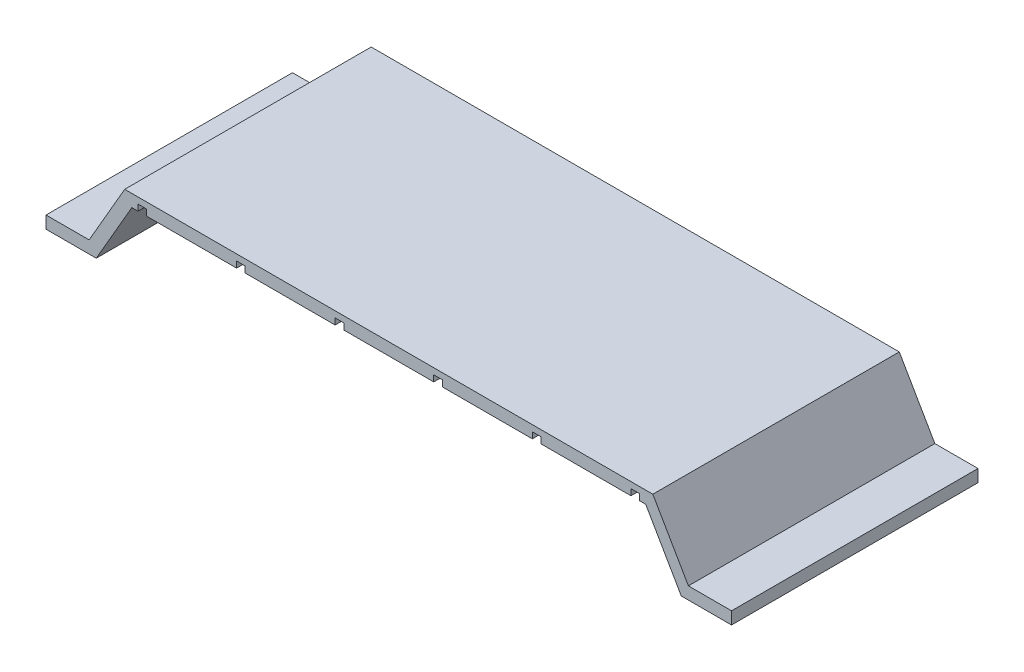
ISO-10303-21;
HEADER;
FILE_DESCRIPTION(('STEP AP214'),'2;1');
FILE_NAME('part.step','',(''),(''),'','','');
FILE_SCHEMA(('AUTOMOTIVE_DESIGN { 1 0 10303 214 1 1 1 1 }'));
ENDSEC;
DATA;
#1=APPLICATION_CONTEXT('core data for automotive mechanical design processes');
#2=APPLICATION_PROTOCOL_DEFINITION('international standard','automotive_design',2000,#1);
#3=PRODUCT_CONTEXT('',#1,'mechanical');
#4=PRODUCT('Part','Part','',(#3));
#5=PRODUCT_RELATED_PRODUCT_CATEGORY('part','',(#4));
#6=PRODUCT_DEFINITION_FORMATION('','',#4);
#7=PRODUCT_DEFINITION_CONTEXT('part definition',#1,'design');
#8=PRODUCT_DEFINITION('design','',#6,#7);
#9=PRODUCT_DEFINITION_SHAPE('','',#8);
#10=(LENGTH_UNIT() NAMED_UNIT(*) SI_UNIT(.MILLI.,.METRE.));
#11=(NAMED_UNIT(*) PLANE_ANGLE_UNIT() SI_UNIT($,.RADIAN.));
#12=(NAMED_UNIT(*) SI_UNIT($,.STERADIAN.) SOLID_ANGLE_UNIT());
#13=UNCERTAINTY_MEASURE_WITH_UNIT(LENGTH_MEASURE(1.E-05),#10,'distance_accuracy_value','');
#14=(GEOMETRIC_REPRESENTATION_CONTEXT(3) GLOBAL_UNCERTAINTY_ASSIGNED_CONTEXT((#13)) GLOBAL_UNIT_ASSIGNED_CONTEXT((#10,
#11,#12)) REPRESENTATION_CONTEXT('',''));
#15=CARTESIAN_POINT('',(0.,0.,0.));
#16=DIRECTION('',(0.,0.,1.));
#17=DIRECTION('',(1.,0.,0.));
#18=AXIS2_PLACEMENT_3D('',#15,#16,#17);
#19=CARTESIAN_POINT('',(-51.689,0.,25.4));
#20=DIRECTION('',(0.,1.,0.));
#21=DIRECTION('',(-1.,0.,0.));
#22=AXIS2_PLACEMENT_3D('',#19,#20,#21);
#23=PLANE('',#22);
#24=DIRECTION('',(1.,0.,0.));
#25=VECTOR('',#24,1.);
#26=CARTESIAN_POINT('',(-51.689,0.,-25.4));
#27=LINE('',#26,#25);
#28=CARTESIAN_POINT('',(-52.959,0.,-25.4));
#29=VERTEX_POINT('',#28);
#30=CARTESIAN_POINT('',(-51.689,0.,-25.4));
#31=VERTEX_POINT('',#30);
#32=EDGE_CURVE('E296',#29,#31,#27,.T.);
#33=ORIENTED_EDGE('',*,*,#32,.T.);
#34=DIRECTION('',(0.,0.,-1.));
#35=VECTOR('',#34,1.);
#36=CARTESIAN_POINT('',(-51.689,0.,25.4));
#37=LINE('',#36,#35);
#38=CARTESIAN_POINT('',(-51.689,0.,25.4));
#39=VERTEX_POINT('',#38);
#40=EDGE_CURVE('E11',#39,#31,#37,.T.);
#41=ORIENTED_EDGE('',*,*,#40,.F.);
#42=DIRECTION('',(1.,0.,0.));
#43=VECTOR('',#42,1.);
#44=CARTESIAN_POINT('',(-51.689,0.,25.4));
#45=LINE('',#44,#43);
#46=CARTESIAN_POINT('',(-52.959,0.,25.4));
#47=VERTEX_POINT('',#46);
#48=EDGE_CURVE('E366',#47,#39,#45,.T.);
#49=ORIENTED_EDGE('',*,*,#48,.F.);
#50=DIRECTION('',(0.,0.,-1.));
#51=VECTOR('',#50,1.);
#52=CARTESIAN_POINT('',(-52.959,0.,25.4));
#53=LINE('',#52,#51);
#54=EDGE_CURVE('E292',#47,#29,#53,.T.);
#55=ORIENTED_EDGE('',*,*,#54,.T.);
#56=EDGE_LOOP('',(#33,#41,#49,#55));
#57=FACE_BOUND('',#56,.T.);
#58=ADVANCED_FACE('F32',(#57),#23,.F.);
#59=CARTESIAN_POINT('',(-51.689,0.,25.4));
#60=DIRECTION('',(-1.,0.,0.));
#61=DIRECTION('',(0.,0.,1.));
#62=AXIS2_PLACEMENT_3D('',#59,#60,#61);
#63=PLANE('',#62);
#64=DIRECTION('',(0.,1.,0.));
#65=VECTOR('',#64,1.);
#66=CARTESIAN_POINT('',(-51.689,0.,-25.4));
#67=LINE('',#66,#65);
#68=CARTESIAN_POINT('',(-51.689,1.27,-25.4));
#69=VERTEX_POINT('',#68);
#70=EDGE_CURVE('E299',#31,#69,#67,.T.);
#71=ORIENTED_EDGE('',*,*,#70,.T.);
#72=DIRECTION('',(0.,0.,-1.));
#73=VECTOR('',#72,1.);
#74=CARTESIAN_POINT('',(-51.689,1.27,25.4));
#75=LINE('',#74,#73);
#76=CARTESIAN_POINT('',(-51.689,1.27,25.4));
#77=VERTEX_POINT('',#76);
#78=EDGE_CURVE('E40',#77,#69,#75,.T.);
#79=ORIENTED_EDGE('',*,*,#78,.F.);
#80=DIRECTION('',(0.,1.,0.));
#81=VECTOR('',#80,1.);
#82=CARTESIAN_POINT('',(-51.689,0.,25.4));
#83=LINE('',#82,#81);
#84=EDGE_CURVE('E175',#39,#77,#83,.T.);
#85=ORIENTED_EDGE('',*,*,#84,.F.);
#86=ORIENTED_EDGE('',*,*,#40,.T.);
#87=EDGE_LOOP('',(#71,#79,#85,#86));
#88=FACE_BOUND('',#87,.T.);
#89=ADVANCED_FACE('F564',(#88),#63,.F.);
#90=CARTESIAN_POINT('',(-51.689,1.27,25.4));
#91=DIRECTION('',(0.,1.,0.));
#92=DIRECTION('',(0.,0.,1.));
#93=AXIS2_PLACEMENT_3D('',#90,#91,#92);
#94=PLANE('',#93);
#95=DIRECTION('',(1.,0.,0.));
#96=VECTOR('',#95,1.);
#97=CARTESIAN_POINT('',(-51.689,1.27,-25.4));
#98=LINE('',#97,#96);
#99=CARTESIAN_POINT('',(-49.911,1.27,-25.4));
#100=VERTEX_POINT('',#99);
#101=EDGE_CURVE('E301',#69,#100,#98,.T.);
#102=ORIENTED_EDGE('',*,*,#101,.T.);
#103=DIRECTION('',(0.,0.,-1.));
#104=VECTOR('',#103,1.);
#105=CARTESIAN_POINT('',(-49.911,1.27,25.4));
#106=LINE('',#105,#104);
#107=CARTESIAN_POINT('',(-49.911,1.27,25.4));
#108=VERTEX_POINT('',#107);
#109=EDGE_CURVE('E457',#108,#100,#106,.T.);
#110=ORIENTED_EDGE('',*,*,#109,.F.);
#111=DIRECTION('',(1.,0.,0.));
#112=VECTOR('',#111,1.);
#113=CARTESIAN_POINT('',(-51.689,1.27,25.4));
#114=LINE('',#113,#112);
#115=EDGE_CURVE('E465',#77,#108,#114,.T.);
#116=ORIENTED_EDGE('',*,*,#115,.F.);
#117=ORIENTED_EDGE('',*,*,#78,.T.);
#118=EDGE_LOOP('',(#102,#110,#116,#117));
#119=FACE_BOUND('',#118,.T.);
#120=ADVANCED_FACE('F463',(#119),#94,.F.);
#121=CARTESIAN_POINT('',(-49.911,0.,25.4));
#122=DIRECTION('',(1.,0.,0.));
#123=DIRECTION('',(0.,0.,-1.));
#124=AXIS2_PLACEMENT_3D('',#121,#122,#123);
#125=PLANE('',#124);
#126=DIRECTION('',(0.,-1.,0.));
#127=VECTOR('',#126,1.);
#128=CARTESIAN_POINT('',(-49.911,0.,-25.4));
#129=LINE('',#128,#127);
#130=CARTESIAN_POINT('',(-49.911,0.,-25.4));
#131=VERTEX_POINT('',#130);
#132=EDGE_CURVE('E303',#100,#131,#129,.T.);
#133=ORIENTED_EDGE('',*,*,#132,.T.);
#134=DIRECTION('',(0.,0.,-1.));
#135=VECTOR('',#134,1.);
#136=CARTESIAN_POINT('',(-49.911,0.,25.4));
#137=LINE('',#136,#135);
#138=CARTESIAN_POINT('',(-49.911,0.,25.4));
#139=VERTEX_POINT('',#138);
#140=EDGE_CURVE('E454',#139,#131,#137,.T.);
#141=ORIENTED_EDGE('',*,*,#140,.F.);
#142=DIRECTION('',(0.,-1.,0.));
#143=VECTOR('',#142,1.);
#144=CARTESIAN_POINT('',(-49.911,0.,25.4));
#145=LINE('',#144,#143);
#146=EDGE_CURVE('E483',#108,#139,#145,.T.);
#147=ORIENTED_EDGE('',*,*,#146,.F.);
#148=ORIENTED_EDGE('',*,*,#109,.T.);
#149=EDGE_LOOP('',(#133,#141,#147,#148));
#150=FACE_BOUND('',#149,.T.);
#151=ADVANCED_FACE('F474',(#150),#125,.F.);
#152=CARTESIAN_POINT('',(-31.369,0.,25.4));
#153=DIRECTION('',(0.,1.,0.));
#154=DIRECTION('',(-1.,0.,0.));
#155=AXIS2_PLACEMENT_3D('',#152,#153,#154);
#156=PLANE('',#155);
#157=DIRECTION('',(1.,0.,0.));
#158=VECTOR('',#157,1.);
#159=CARTESIAN_POINT('',(-31.369,0.,-25.4));
#160=LINE('',#159,#158);
#161=CARTESIAN_POINT('',(-31.369,0.,-25.4));
#162=VERTEX_POINT('',#161);
#163=EDGE_CURVE('E305',#131,#162,#160,.T.);
#164=ORIENTED_EDGE('',*,*,#163,.T.);
#165=DIRECTION('',(0.,0.,-1.));
#166=VECTOR('',#165,1.);
#167=CARTESIAN_POINT('',(-31.369,0.,25.4));
#168=LINE('',#167,#166);
#169=CARTESIAN_POINT('',(-31.369,0.,25.4));
#170=VERTEX_POINT('',#169);
#171=EDGE_CURVE('E451',#170,#162,#168,.T.);
#172=ORIENTED_EDGE('',*,*,#171,.F.);
#173=DIRECTION('',(1.,0.,0.));
#174=VECTOR('',#173,1.);
#175=CARTESIAN_POINT('',(-31.369,0.,25.4));
#176=LINE('',#175,#174);
#177=EDGE_CURVE('E480',#139,#170,#176,.T.);
#178=ORIENTED_EDGE('',*,*,#177,.F.);
#179=ORIENTED_EDGE('',*,*,#140,.T.);
#180=EDGE_LOOP('',(#164,#172,#178,#179));
#181=FACE_BOUND('',#180,.T.);
#182=ADVANCED_FACE('F478',(#181),#156,.F.);
#183=CARTESIAN_POINT('',(-31.369,0.,25.4));
#184=DIRECTION('',(-1.,0.,0.));
#185=DIRECTION('',(0.,0.,1.));
#186=AXIS2_PLACEMENT_3D('',#183,#184,#185);
#187=PLANE('',#186);
#188=DIRECTION('',(0.,1.,0.));
#189=VECTOR('',#188,1.);
#190=CARTESIAN_POINT('',(-31.369,0.,-25.4));
#191=LINE('',#190,#189);
#192=CARTESIAN_POINT('',(-31.369,1.27,-25.4));
#193=VERTEX_POINT('',#192);
#194=EDGE_CURVE('E307',#162,#193,#191,.T.);
#195=ORIENTED_EDGE('',*,*,#194,.T.);
#196=DIRECTION('',(0.,0.,-1.));
#197=VECTOR('',#196,1.);
#198=CARTESIAN_POINT('',(-31.369,1.27,25.4));
#199=LINE('',#198,#197);
#200=CARTESIAN_POINT('',(-31.369,1.27,25.4));
#201=VERTEX_POINT('',#200);
#202=EDGE_CURVE('E448',#201,#193,#199,.T.);
#203=ORIENTED_EDGE('',*,*,#202,.F.);
#204=DIRECTION('',(0.,1.,0.));
#205=VECTOR('',#204,1.);
#206=CARTESIAN_POINT('',(-31.369,0.,25.4));
#207=LINE('',#206,#205);
#208=EDGE_CURVE('E482',#170,#201,#207,.T.);
#209=ORIENTED_EDGE('',*,*,#208,.F.);
#210=ORIENTED_EDGE('',*,*,#171,.T.);
#211=EDGE_LOOP('',(#195,#203,#209,#210));
#212=FACE_BOUND('',#211,.T.);
#213=ADVANCED_FACE('F577',(#212),#187,.F.);
#214=CARTESIAN_POINT('',(-31.369,1.27,25.4));
#215=DIRECTION('',(0.,1.,0.));
#216=DIRECTION('',(0.,0.,1.));
#217=AXIS2_PLACEMENT_3D('',#214,#215,#216);
#218=PLANE('',#217);
#219=DIRECTION('',(1.,0.,0.));
#220=VECTOR('',#219,1.);
#221=CARTESIAN_POINT('',(-31.369,1.27,-25.4));
#222=LINE('',#221,#220);
#223=CARTESIAN_POINT('',(-29.591,1.27,-25.4));
#224=VERTEX_POINT('',#223);
#225=EDGE_CURVE('E309',#193,#224,#222,.T.);
#226=ORIENTED_EDGE('',*,*,#225,.T.);
#227=DIRECTION('',(0.,0.,-1.));
#228=VECTOR('',#227,1.);
#229=CARTESIAN_POINT('',(-29.591,1.27,25.4));
#230=LINE('',#229,#228);
#231=CARTESIAN_POINT('',(-29.591,1.27,25.4));
#232=VERTEX_POINT('',#231);
#233=EDGE_CURVE('E445',#232,#224,#230,.T.);
#234=ORIENTED_EDGE('',*,*,#233,.F.);
#235=DIRECTION('',(1.,0.,0.));
#236=VECTOR('',#235,1.);
#237=CARTESIAN_POINT('',(-31.369,1.27,25.4));
#238=LINE('',#237,#236);
#239=EDGE_CURVE('E485',#201,#232,#238,.T.);
#240=ORIENTED_EDGE('',*,*,#239,.F.);
#241=ORIENTED_EDGE('',*,*,#202,.T.);
#242=EDGE_LOOP('',(#226,#234,#240,#241));
#243=FACE_BOUND('',#242,.T.);
#244=ADVANCED_FACE('F580',(#243),#218,.F.);
#245=CARTESIAN_POINT('',(-29.591,0.,25.4));
#246=DIRECTION('',(1.,0.,0.));
#247=DIRECTION('',(0.,0.,-1.));
#248=AXIS2_PLACEMENT_3D('',#245,#246,#247);
#249=PLANE('',#248);
#250=DIRECTION('',(0.,-1.,0.));
#251=VECTOR('',#250,1.);
#252=CARTESIAN_POINT('',(-29.591,0.,-25.4));
#253=LINE('',#252,#251);
#254=CARTESIAN_POINT('',(-29.591,0.,-25.4));
#255=VERTEX_POINT('',#254);
#256=EDGE_CURVE('E311',#224,#255,#253,.T.);
#257=ORIENTED_EDGE('',*,*,#256,.T.);
#258=DIRECTION('',(0.,0.,-1.));
#259=VECTOR('',#258,1.);
#260=CARTESIAN_POINT('',(-29.591,0.,25.4));
#261=LINE('',#260,#259);
#262=CARTESIAN_POINT('',(-29.591,0.,25.4));
#263=VERTEX_POINT('',#262);
#264=EDGE_CURVE('E442',#263,#255,#261,.T.);
#265=ORIENTED_EDGE('',*,*,#264,.F.);
#266=DIRECTION('',(0.,-1.,0.));
#267=VECTOR('',#266,1.);
#268=CARTESIAN_POINT('',(-29.591,0.,25.4));
#269=LINE('',#268,#267);
#270=EDGE_CURVE('E491',#232,#263,#269,.T.);
#271=ORIENTED_EDGE('',*,*,#270,.F.);
#272=ORIENTED_EDGE('',*,*,#233,.T.);
#273=EDGE_LOOP('',(#257,#265,#271,#272));
#274=FACE_BOUND('',#273,.T.);
#275=ADVANCED_FACE('F584',(#274),#249,.F.);
#276=CARTESIAN_POINT('',(-11.049,0.,25.4));
#277=DIRECTION('',(0.,1.,0.));
#278=DIRECTION('',(-1.,0.,0.));
#279=AXIS2_PLACEMENT_3D('',#276,#277,#278);
#280=PLANE('',#279);
#281=DIRECTION('',(1.,0.,0.));
#282=VECTOR('',#281,1.);
#283=CARTESIAN_POINT('',(-11.049,0.,-25.4));
#284=LINE('',#283,#282);
#285=CARTESIAN_POINT('',(-11.049,0.,-25.4));
#286=VERTEX_POINT('',#285);
#287=EDGE_CURVE('E313',#255,#286,#284,.T.);
#288=ORIENTED_EDGE('',*,*,#287,.T.);
#289=DIRECTION('',(0.,0.,-1.));
#290=VECTOR('',#289,1.);
#291=CARTESIAN_POINT('',(-11.049,0.,25.4));
#292=LINE('',#291,#290);
#293=CARTESIAN_POINT('',(-11.049,0.,25.4));
#294=VERTEX_POINT('',#293);
#295=EDGE_CURVE('E439',#294,#286,#292,.T.);
#296=ORIENTED_EDGE('',*,*,#295,.F.);
#297=DIRECTION('',(1.,0.,0.));
#298=VECTOR('',#297,1.);
#299=CARTESIAN_POINT('',(-11.049,0.,25.4));
#300=LINE('',#299,#298);
#301=EDGE_CURVE('E493',#263,#294,#300,.T.);
#302=ORIENTED_EDGE('',*,*,#301,.F.);
#303=ORIENTED_EDGE('',*,*,#264,.T.);
#304=EDGE_LOOP('',(#288,#296,#302,#303));
#305=FACE_BOUND('',#304,.T.);
#306=ADVANCED_FACE('F588',(#305),#280,.F.);
#307=CARTESIAN_POINT('',(-11.049,0.,25.4));
#308=DIRECTION('',(-1.,0.,0.));
#309=DIRECTION('',(0.,0.,1.));
#310=AXIS2_PLACEMENT_3D('',#307,#308,#309);
#311=PLANE('',#310);
#312=DIRECTION('',(0.,1.,0.));
#313=VECTOR('',#312,1.);
#314=CARTESIAN_POINT('',(-11.049,0.,-25.4));
#315=LINE('',#314,#313);
#316=CARTESIAN_POINT('',(-11.049,1.27,-25.4));
#317=VERTEX_POINT('',#316);
#318=EDGE_CURVE('E315',#286,#317,#315,.T.);
#319=ORIENTED_EDGE('',*,*,#318,.T.);
#320=DIRECTION('',(0.,0.,-1.));
#321=VECTOR('',#320,1.);
#322=CARTESIAN_POINT('',(-11.049,1.27,25.4));
#323=LINE('',#322,#321);
#324=CARTESIAN_POINT('',(-11.049,1.27,25.4));
#325=VERTEX_POINT('',#324);
#326=EDGE_CURVE('E436',#325,#317,#323,.T.);
#327=ORIENTED_EDGE('',*,*,#326,.F.);
#328=DIRECTION('',(0.,1.,0.));
#329=VECTOR('',#328,1.);
#330=CARTESIAN_POINT('',(-11.049,0.,25.4));
#331=LINE('',#330,#329);
#332=EDGE_CURVE('E495',#294,#325,#331,.T.);
#333=ORIENTED_EDGE('',*,*,#332,.F.);
#334=ORIENTED_EDGE('',*,*,#295,.T.);
#335=EDGE_LOOP('',(#319,#327,#333,#334));
#336=FACE_BOUND('',#335,.T.);
#337=ADVANCED_FACE('F592',(#336),#311,.F.);
#338=CARTESIAN_POINT('',(-11.049,1.27,25.4));
#339=DIRECTION('',(0.,1.,0.));
#340=DIRECTION('',(-1.,0.,0.));
#341=AXIS2_PLACEMENT_3D('',#338,#339,#340);
#342=PLANE('',#341);
#343=DIRECTION('',(1.,0.,0.));
#344=VECTOR('',#343,1.);
#345=CARTESIAN_POINT('',(-11.049,1.27,-25.4));
#346=LINE('',#345,#344);
#347=CARTESIAN_POINT('',(-9.271,1.27,-25.4));
#348=VERTEX_POINT('',#347);
#349=EDGE_CURVE('E317',#317,#348,#346,.T.);
#350=ORIENTED_EDGE('',*,*,#349,.T.);
#351=DIRECTION('',(0.,0.,-1.));
#352=VECTOR('',#351,1.);
#353=CARTESIAN_POINT('',(-9.271,1.27,25.4));
#354=LINE('',#353,#352);
#355=CARTESIAN_POINT('',(-9.271,1.27,25.4));
#356=VERTEX_POINT('',#355);
#357=EDGE_CURVE('E433',#356,#348,#354,.T.);
#358=ORIENTED_EDGE('',*,*,#357,.F.);
#359=DIRECTION('',(1.,0.,0.));
#360=VECTOR('',#359,1.);
#361=CARTESIAN_POINT('',(-11.049,1.27,25.4));
#362=LINE('',#361,#360);
#363=EDGE_CURVE('E497',#325,#356,#362,.T.);
#364=ORIENTED_EDGE('',*,*,#363,.F.);
#365=ORIENTED_EDGE('',*,*,#326,.T.);
#366=EDGE_LOOP('',(#350,#358,#364,#365));
#367=FACE_BOUND('',#366,.T.);
#368=ADVANCED_FACE('F596',(#367),#342,.F.);
#369=CARTESIAN_POINT('',(-9.271,0.,25.4));
#370=DIRECTION('',(1.,0.,0.));
#371=DIRECTION('',(0.,0.,-1.));
#372=AXIS2_PLACEMENT_3D('',#369,#370,#371);
#373=PLANE('',#372);
#374=DIRECTION('',(0.,-1.,0.));
#375=VECTOR('',#374,1.);
#376=CARTESIAN_POINT('',(-9.271,0.,-25.4));
#377=LINE('',#376,#375);
#378=CARTESIAN_POINT('',(-9.271,0.,-25.4));
#379=VERTEX_POINT('',#378);
#380=EDGE_CURVE('E319',#348,#379,#377,.T.);
#381=ORIENTED_EDGE('',*,*,#380,.T.);
#382=DIRECTION('',(0.,0.,-1.));
#383=VECTOR('',#382,1.);
#384=CARTESIAN_POINT('',(-9.271,0.,25.4));
#385=LINE('',#384,#383);
#386=CARTESIAN_POINT('',(-9.271,0.,25.4));
#387=VERTEX_POINT('',#386);
#388=EDGE_CURVE('E430',#387,#379,#385,.T.);
#389=ORIENTED_EDGE('',*,*,#388,.F.);
#390=DIRECTION('',(0.,-1.,0.));
#391=VECTOR('',#390,1.);
#392=CARTESIAN_POINT('',(-9.271,0.,25.4));
#393=LINE('',#392,#391);
#394=EDGE_CURVE('E499',#356,#387,#393,.T.);
#395=ORIENTED_EDGE('',*,*,#394,.F.);
#396=ORIENTED_EDGE('',*,*,#357,.T.);
#397=EDGE_LOOP('',(#381,#389,#395,#396));
#398=FACE_BOUND('',#397,.T.);
#399=ADVANCED_FACE('F600',(#398),#373,.F.);
#400=CARTESIAN_POINT('',(9.271,0.,25.4));
#401=DIRECTION('',(0.,1.,0.));
#402=DIRECTION('',(0.,0.,1.));
#403=AXIS2_PLACEMENT_3D('',#400,#401,#402);
#404=PLANE('',#403);
#405=DIRECTION('',(1.,0.,0.));
#406=VECTOR('',#405,1.);
#407=CARTESIAN_POINT('',(9.271,0.,-25.4));
#408=LINE('',#407,#406);
#409=CARTESIAN_POINT('',(9.271,0.,-25.4));
#410=VERTEX_POINT('',#409);
#411=EDGE_CURVE('E321',#379,#410,#408,.T.);
#412=ORIENTED_EDGE('',*,*,#411,.T.);
#413=DIRECTION('',(0.,0.,-1.));
#414=VECTOR('',#413,1.);
#415=CARTESIAN_POINT('',(9.271,0.,25.4));
#416=LINE('',#415,#414);
#417=CARTESIAN_POINT('',(9.271,0.,25.4));
#418=VERTEX_POINT('',#417);
#419=EDGE_CURVE('E427',#418,#410,#416,.T.);
#420=ORIENTED_EDGE('',*,*,#419,.F.);
#421=DIRECTION('',(1.,0.,0.));
#422=VECTOR('',#421,1.);
#423=CARTESIAN_POINT('',(9.271,0.,25.4));
#424=LINE('',#423,#422);
#425=EDGE_CURVE('E501',#387,#418,#424,.T.);
#426=ORIENTED_EDGE('',*,*,#425,.F.);
#427=ORIENTED_EDGE('',*,*,#388,.T.);
#428=EDGE_LOOP('',(#412,#420,#426,#427));
#429=FACE_BOUND('',#428,.T.);
#430=ADVANCED_FACE('F604',(#429),#404,.F.);
#431=CARTESIAN_POINT('',(9.271,0.,25.4));
#432=DIRECTION('',(-1.,0.,0.));
#433=DIRECTION('',(0.,0.,1.));
#434=AXIS2_PLACEMENT_3D('',#431,#432,#433);
#435=PLANE('',#434);
#436=DIRECTION('',(0.,1.,0.));
#437=VECTOR('',#436,1.);
#438=CARTESIAN_POINT('',(9.271,0.,-25.4));
#439=LINE('',#438,#437);
#440=CARTESIAN_POINT('',(9.271,1.27,-25.4));
#441=VERTEX_POINT('',#440);
#442=EDGE_CURVE('E323',#410,#441,#439,.T.);
#443=ORIENTED_EDGE('',*,*,#442,.T.);
#444=DIRECTION('',(0.,0.,-1.));
#445=VECTOR('',#444,1.);
#446=CARTESIAN_POINT('',(9.271,1.27,25.4));
#447=LINE('',#446,#445);
#448=CARTESIAN_POINT('',(9.271,1.27,25.4));
#449=VERTEX_POINT('',#448);
#450=EDGE_CURVE('E424',#449,#441,#447,.T.);
#451=ORIENTED_EDGE('',*,*,#450,.F.);
#452=DIRECTION('',(0.,1.,0.));
#453=VECTOR('',#452,1.);
#454=CARTESIAN_POINT('',(9.271,0.,25.4));
#455=LINE('',#454,#453);
#456=EDGE_CURVE('E503',#418,#449,#455,.T.);
#457=ORIENTED_EDGE('',*,*,#456,.F.);
#458=ORIENTED_EDGE('',*,*,#419,.T.);
#459=EDGE_LOOP('',(#443,#451,#457,#458));
#460=FACE_BOUND('',#459,.T.);
#461=ADVANCED_FACE('F608',(#460),#435,.F.);
#462=CARTESIAN_POINT('',(11.049,1.27,25.4));
#463=DIRECTION('',(0.,1.,0.));
#464=DIRECTION('',(-1.,0.,0.));
#465=AXIS2_PLACEMENT_3D('',#462,#463,#464);
#466=PLANE('',#465);
#467=DIRECTION('',(1.,0.,0.));
#468=VECTOR('',#467,1.);
#469=CARTESIAN_POINT('',(11.049,1.27,-25.4));
#470=LINE('',#469,#468);
#471=CARTESIAN_POINT('',(11.049,1.27,-25.4));
#472=VERTEX_POINT('',#471);
#473=EDGE_CURVE('E325',#441,#472,#470,.T.);
#474=ORIENTED_EDGE('',*,*,#473,.T.);
#475=DIRECTION('',(0.,0.,-1.));
#476=VECTOR('',#475,1.);
#477=CARTESIAN_POINT('',(11.049,1.27,25.4));
#478=LINE('',#477,#476);
#479=CARTESIAN_POINT('',(11.049,1.27,25.4));
#480=VERTEX_POINT('',#479);
#481=EDGE_CURVE('E421',#480,#472,#478,.T.);
#482=ORIENTED_EDGE('',*,*,#481,.F.);
#483=DIRECTION('',(1.,0.,0.));
#484=VECTOR('',#483,1.);
#485=CARTESIAN_POINT('',(11.049,1.27,25.4));
#486=LINE('',#485,#484);
#487=EDGE_CURVE('E505',#449,#480,#486,.T.);
#488=ORIENTED_EDGE('',*,*,#487,.F.);
#489=ORIENTED_EDGE('',*,*,#450,.T.);
#490=EDGE_LOOP('',(#474,#482,#488,#489));
#491=FACE_BOUND('',#490,.T.);
#492=ADVANCED_FACE('F612',(#491),#466,.F.);
#493=CARTESIAN_POINT('',(11.049,0.,25.4));
#494=DIRECTION('',(1.,0.,0.));
#495=DIRECTION('',(0.,0.,-1.));
#496=AXIS2_PLACEMENT_3D('',#493,#494,#495);
#497=PLANE('',#496);
#498=DIRECTION('',(0.,-1.,0.));
#499=VECTOR('',#498,1.);
#500=CARTESIAN_POINT('',(11.049,0.,-25.4));
#501=LINE('',#500,#499);
#502=CARTESIAN_POINT('',(11.049,0.,-25.4));
#503=VERTEX_POINT('',#502);
#504=EDGE_CURVE('E327',#472,#503,#501,.T.);
#505=ORIENTED_EDGE('',*,*,#504,.T.);
#506=DIRECTION('',(0.,0.,-1.));
#507=VECTOR('',#506,1.);
#508=CARTESIAN_POINT('',(11.049,0.,25.4));
#509=LINE('',#508,#507);
#510=CARTESIAN_POINT('',(11.049,0.,25.4));
#511=VERTEX_POINT('',#510);
#512=EDGE_CURVE('E418',#511,#503,#509,.T.);
#513=ORIENTED_EDGE('',*,*,#512,.F.);
#514=DIRECTION('',(0.,-1.,0.));
#515=VECTOR('',#514,1.);
#516=CARTESIAN_POINT('',(11.049,0.,25.4));
#517=LINE('',#516,#515);
#518=EDGE_CURVE('E507',#480,#511,#517,.T.);
#519=ORIENTED_EDGE('',*,*,#518,.F.);
#520=ORIENTED_EDGE('',*,*,#481,.T.);
#521=EDGE_LOOP('',(#505,#513,#519,#520));
#522=FACE_BOUND('',#521,.T.);
#523=ADVANCED_FACE('F616',(#522),#497,.F.);
#524=CARTESIAN_POINT('',(11.049,0.,25.4));
#525=DIRECTION('',(0.,1.,0.));
#526=DIRECTION('',(-1.,0.,0.));
#527=AXIS2_PLACEMENT_3D('',#524,#525,#526);
#528=PLANE('',#527);
#529=DIRECTION('',(1.,0.,0.));
#530=VECTOR('',#529,1.);
#531=CARTESIAN_POINT('',(11.049,0.,-25.4));
#532=LINE('',#531,#530);
#533=CARTESIAN_POINT('',(29.591,0.,-25.4));
#534=VERTEX_POINT('',#533);
#535=EDGE_CURVE('E329',#503,#534,#532,.T.);
#536=ORIENTED_EDGE('',*,*,#535,.T.);
#537=DIRECTION('',(0.,0.,-1.));
#538=VECTOR('',#537,1.);
#539=CARTESIAN_POINT('',(29.591,0.,25.4));
#540=LINE('',#539,#538);
#541=CARTESIAN_POINT('',(29.591,0.,25.4));
#542=VERTEX_POINT('',#541);
#543=EDGE_CURVE('E415',#542,#534,#540,.T.);
#544=ORIENTED_EDGE('',*,*,#543,.F.);
#545=DIRECTION('',(1.,0.,0.));
#546=VECTOR('',#545,1.);
#547=CARTESIAN_POINT('',(11.049,0.,25.4));
#548=LINE('',#547,#546);
#549=EDGE_CURVE('E509',#511,#542,#548,.T.);
#550=ORIENTED_EDGE('',*,*,#549,.F.);
#551=ORIENTED_EDGE('',*,*,#512,.T.);
#552=EDGE_LOOP('',(#536,#544,#550,#551));
#553=FACE_BOUND('',#552,.T.);
#554=ADVANCED_FACE('F620',(#553),#528,.F.);
#555=CARTESIAN_POINT('',(29.591,0.,25.4));
#556=DIRECTION('',(-1.,0.,0.));
#557=DIRECTION('',(0.,0.,1.));
#558=AXIS2_PLACEMENT_3D('',#555,#556,#557);
#559=PLANE('',#558);
#560=DIRECTION('',(0.,1.,0.));
#561=VECTOR('',#560,1.);
#562=CARTESIAN_POINT('',(29.591,0.,-25.4));
#563=LINE('',#562,#561);
#564=CARTESIAN_POINT('',(29.591,1.27,-25.4));
#565=VERTEX_POINT('',#564);
#566=EDGE_CURVE('E331',#534,#565,#563,.T.);
#567=ORIENTED_EDGE('',*,*,#566,.T.);
#568=DIRECTION('',(0.,0.,-1.));
#569=VECTOR('',#568,1.);
#570=CARTESIAN_POINT('',(29.591,1.27,25.4));
#571=LINE('',#570,#569);
#572=CARTESIAN_POINT('',(29.591,1.27,25.4));
#573=VERTEX_POINT('',#572);
#574=EDGE_CURVE('E412',#573,#565,#571,.T.);
#575=ORIENTED_EDGE('',*,*,#574,.F.);
#576=DIRECTION('',(0.,1.,0.));
#577=VECTOR('',#576,1.);
#578=CARTESIAN_POINT('',(29.591,0.,25.4));
#579=LINE('',#578,#577);
#580=EDGE_CURVE('E511',#542,#573,#579,.T.);
#581=ORIENTED_EDGE('',*,*,#580,.F.);
#582=ORIENTED_EDGE('',*,*,#543,.T.);
#583=EDGE_LOOP('',(#567,#575,#581,#582));
#584=FACE_BOUND('',#583,.T.);
#585=ADVANCED_FACE('F624',(#584),#559,.F.);
#586=CARTESIAN_POINT('',(31.369,1.27,25.4));
#587=DIRECTION('',(0.,1.,0.));
#588=DIRECTION('',(0.,0.,1.));
#589=AXIS2_PLACEMENT_3D('',#586,#587,#588);
#590=PLANE('',#589);
#591=DIRECTION('',(1.,0.,0.));
#592=VECTOR('',#591,1.);
#593=CARTESIAN_POINT('',(31.369,1.27,-25.4));
#594=LINE('',#593,#592);
#595=CARTESIAN_POINT('',(31.369,1.27,-25.4));
#596=VERTEX_POINT('',#595);
#597=EDGE_CURVE('E333',#565,#596,#594,.T.);
#598=ORIENTED_EDGE('',*,*,#597,.T.);
#599=DIRECTION('',(0.,0.,-1.));
#600=VECTOR('',#599,1.);
#601=CARTESIAN_POINT('',(31.369,1.27,25.4));
#602=LINE('',#601,#600);
#603=CARTESIAN_POINT('',(31.369,1.27,25.4));
#604=VERTEX_POINT('',#603);
#605=EDGE_CURVE('E409',#604,#596,#602,.T.);
#606=ORIENTED_EDGE('',*,*,#605,.F.);
#607=DIRECTION('',(1.,0.,0.));
#608=VECTOR('',#607,1.);
#609=CARTESIAN_POINT('',(31.369,1.27,25.4));
#610=LINE('',#609,#608);
#611=EDGE_CURVE('E513',#573,#604,#610,.T.);
#612=ORIENTED_EDGE('',*,*,#611,.F.);
#613=ORIENTED_EDGE('',*,*,#574,.T.);
#614=EDGE_LOOP('',(#598,#606,#612,#613));
#615=FACE_BOUND('',#614,.T.);
#616=ADVANCED_FACE('F628',(#615),#590,.F.);
#617=CARTESIAN_POINT('',(31.369,0.,25.4));
#618=DIRECTION('',(1.,0.,0.));
#619=DIRECTION('',(0.,0.,-1.));
#620=AXIS2_PLACEMENT_3D('',#617,#618,#619);
#621=PLANE('',#620);
#622=DIRECTION('',(0.,-1.,0.));
#623=VECTOR('',#622,1.);
#624=CARTESIAN_POINT('',(31.369,0.,-25.4));
#625=LINE('',#624,#623);
#626=CARTESIAN_POINT('',(31.369,0.,-25.4));
#627=VERTEX_POINT('',#626);
#628=EDGE_CURVE('E335',#596,#627,#625,.T.);
#629=ORIENTED_EDGE('',*,*,#628,.T.);
#630=DIRECTION('',(0.,0.,-1.));
#631=VECTOR('',#630,1.);
#632=CARTESIAN_POINT('',(31.369,0.,25.4));
#633=LINE('',#632,#631);
#634=CARTESIAN_POINT('',(31.369,0.,25.4));
#635=VERTEX_POINT('',#634);
#636=EDGE_CURVE('E406',#635,#627,#633,.T.);
#637=ORIENTED_EDGE('',*,*,#636,.F.);
#638=DIRECTION('',(0.,-1.,0.));
#639=VECTOR('',#638,1.);
#640=CARTESIAN_POINT('',(31.369,0.,25.4));
#641=LINE('',#640,#639);
#642=EDGE_CURVE('E515',#604,#635,#641,.T.);
#643=ORIENTED_EDGE('',*,*,#642,.F.);
#644=ORIENTED_EDGE('',*,*,#605,.T.);
#645=EDGE_LOOP('',(#629,#637,#643,#644));
#646=FACE_BOUND('',#645,.T.);
#647=ADVANCED_FACE('F632',(#646),#621,.F.);
#648=CARTESIAN_POINT('',(31.369,0.,25.4));
#649=DIRECTION('',(0.,1.,0.));
#650=DIRECTION('',(-1.,0.,0.));
#651=AXIS2_PLACEMENT_3D('',#648,#649,#650);
#652=PLANE('',#651);
#653=DIRECTION('',(1.,0.,0.));
#654=VECTOR('',#653,1.);
#655=CARTESIAN_POINT('',(31.369,0.,-25.4));
#656=LINE('',#655,#654);
#657=CARTESIAN_POINT('',(49.911,0.,-25.4));
#658=VERTEX_POINT('',#657);
#659=EDGE_CURVE('E337',#627,#658,#656,.T.);
#660=ORIENTED_EDGE('',*,*,#659,.T.);
#661=DIRECTION('',(0.,0.,-1.));
#662=VECTOR('',#661,1.);
#663=CARTESIAN_POINT('',(49.911,0.,25.4));
#664=LINE('',#663,#662);
#665=CARTESIAN_POINT('',(49.911,0.,25.4));
#666=VERTEX_POINT('',#665);
#667=EDGE_CURVE('E403',#666,#658,#664,.T.);
#668=ORIENTED_EDGE('',*,*,#667,.F.);
#669=DIRECTION('',(1.,0.,0.));
#670=VECTOR('',#669,1.);
#671=CARTESIAN_POINT('',(31.369,0.,25.4));
#672=LINE('',#671,#670);
#673=EDGE_CURVE('E517',#635,#666,#672,.T.);
#674=ORIENTED_EDGE('',*,*,#673,.F.);
#675=ORIENTED_EDGE('',*,*,#636,.T.);
#676=EDGE_LOOP('',(#660,#668,#674,#675));
#677=FACE_BOUND('',#676,.T.);
#678=ADVANCED_FACE('F636',(#677),#652,.F.);
#679=CARTESIAN_POINT('',(49.911,0.,25.4));
#680=DIRECTION('',(-1.,0.,0.));
#681=DIRECTION('',(0.,0.,1.));
#682=AXIS2_PLACEMENT_3D('',#679,#680,#681);
#683=PLANE('',#682);
#684=DIRECTION('',(0.,1.,0.));
#685=VECTOR('',#684,1.);
#686=CARTESIAN_POINT('',(49.911,0.,-25.4));
#687=LINE('',#686,#685);
#688=CARTESIAN_POINT('',(49.911,1.27,-25.4));
#689=VERTEX_POINT('',#688);
#690=EDGE_CURVE('E339',#658,#689,#687,.T.);
#691=ORIENTED_EDGE('',*,*,#690,.T.);
#692=DIRECTION('',(0.,0.,-1.));
#693=VECTOR('',#692,1.);
#694=CARTESIAN_POINT('',(49.911,1.27,25.4));
#695=LINE('',#694,#693);
#696=CARTESIAN_POINT('',(49.911,1.27,25.4));
#697=VERTEX_POINT('',#696);
#698=EDGE_CURVE('E400',#697,#689,#695,.T.);
#699=ORIENTED_EDGE('',*,*,#698,.F.);
#700=DIRECTION('',(0.,1.,0.));
#701=VECTOR('',#700,1.);
#702=CARTESIAN_POINT('',(49.911,0.,25.4));
#703=LINE('',#702,#701);
#704=EDGE_CURVE('E519',#666,#697,#703,.T.);
#705=ORIENTED_EDGE('',*,*,#704,.F.);
#706=ORIENTED_EDGE('',*,*,#667,.T.);
#707=EDGE_LOOP('',(#691,#699,#705,#706));
#708=FACE_BOUND('',#707,.T.);
#709=ADVANCED_FACE('F640',(#708),#683,.F.);
#710=CARTESIAN_POINT('',(51.689,1.27,25.4));
#711=DIRECTION('',(0.,1.,0.));
#712=DIRECTION('',(0.,0.,1.));
#713=AXIS2_PLACEMENT_3D('',#710,#711,#712);
#714=PLANE('',#713);
#715=DIRECTION('',(1.,0.,0.));
#716=VECTOR('',#715,1.);
#717=CARTESIAN_POINT('',(51.689,1.27,-25.4));
#718=LINE('',#717,#716);
#719=CARTESIAN_POINT('',(51.689,1.27,-25.4));
#720=VERTEX_POINT('',#719);
#721=EDGE_CURVE('E341',#689,#720,#718,.T.);
#722=ORIENTED_EDGE('',*,*,#721,.T.);
#723=DIRECTION('',(0.,0.,-1.));
#724=VECTOR('',#723,1.);
#725=CARTESIAN_POINT('',(51.689,1.27,25.4));
#726=LINE('',#725,#724);
#727=CARTESIAN_POINT('',(51.689,1.27,25.4));
#728=VERTEX_POINT('',#727);
#729=EDGE_CURVE('E397',#728,#720,#726,.T.);
#730=ORIENTED_EDGE('',*,*,#729,.F.);
#731=DIRECTION('',(1.,0.,0.));
#732=VECTOR('',#731,1.);
#733=CARTESIAN_POINT('',(51.689,1.27,25.4));
#734=LINE('',#733,#732);
#735=EDGE_CURVE('E521',#697,#728,#734,.T.);
#736=ORIENTED_EDGE('',*,*,#735,.F.);
#737=ORIENTED_EDGE('',*,*,#698,.T.);
#738=EDGE_LOOP('',(#722,#730,#736,#737));
#739=FACE_BOUND('',#738,.T.);
#740=ADVANCED_FACE('F644',(#739),#714,.F.);
#741=CARTESIAN_POINT('',(51.689,0.,25.4));
#742=DIRECTION('',(1.,0.,0.));
#743=DIRECTION('',(0.,0.,-1.));
#744=AXIS2_PLACEMENT_3D('',#741,#742,#743);
#745=PLANE('',#744);
#746=DIRECTION('',(0.,-1.,0.));
#747=VECTOR('',#746,1.);
#748=CARTESIAN_POINT('',(51.689,0.,-25.4));
#749=LINE('',#748,#747);
#750=CARTESIAN_POINT('',(51.689,0.,-25.4));
#751=VERTEX_POINT('',#750);
#752=EDGE_CURVE('E343',#720,#751,#749,.T.);
#753=ORIENTED_EDGE('',*,*,#752,.T.);
#754=DIRECTION('',(0.,0.,-1.));
#755=VECTOR('',#754,1.);
#756=CARTESIAN_POINT('',(51.689,0.,25.4));
#757=LINE('',#756,#755);
#758=CARTESIAN_POINT('',(51.689,0.,25.4));
#759=VERTEX_POINT('',#758);
#760=EDGE_CURVE('E394',#759,#751,#757,.T.);
#761=ORIENTED_EDGE('',*,*,#760,.F.);
#762=DIRECTION('',(0.,-1.,0.));
#763=VECTOR('',#762,1.);
#764=CARTESIAN_POINT('',(51.689,0.,25.4));
#765=LINE('',#764,#763);
#766=EDGE_CURVE('E523',#728,#759,#765,.T.);
#767=ORIENTED_EDGE('',*,*,#766,.F.);
#768=ORIENTED_EDGE('',*,*,#729,.T.);
#769=EDGE_LOOP('',(#753,#761,#767,#768));
#770=FACE_BOUND('',#769,.T.);
#771=ADVANCED_FACE('F648',(#770),#745,.F.);
#772=CARTESIAN_POINT('',(51.689,0.,25.4));
#773=DIRECTION('',(0.,1.,0.));
#774=DIRECTION('',(-1.,0.,0.));
#775=AXIS2_PLACEMENT_3D('',#772,#773,#774);
#776=PLANE('',#775);
#777=DIRECTION('',(1.,0.,0.));
#778=VECTOR('',#777,1.);
#779=CARTESIAN_POINT('',(51.689,0.,-25.4));
#780=LINE('',#779,#778);
#781=CARTESIAN_POINT('',(52.959,0.,-25.4));
#782=VERTEX_POINT('',#781);
#783=EDGE_CURVE('E345',#751,#782,#780,.T.);
#784=ORIENTED_EDGE('',*,*,#783,.T.);
#785=DIRECTION('',(0.,0.,-1.));
#786=VECTOR('',#785,1.);
#787=CARTESIAN_POINT('',(52.959,0.,25.4));
#788=LINE('',#787,#786);
#789=CARTESIAN_POINT('',(52.959,0.,25.4));
#790=VERTEX_POINT('',#789);
#791=EDGE_CURVE('E391',#790,#782,#788,.T.);
#792=ORIENTED_EDGE('',*,*,#791,.F.);
#793=DIRECTION('',(1.,0.,0.));
#794=VECTOR('',#793,1.);
#795=CARTESIAN_POINT('',(51.689,0.,25.4));
#796=LINE('',#795,#794);
#797=EDGE_CURVE('E525',#759,#790,#796,.T.);
#798=ORIENTED_EDGE('',*,*,#797,.F.);
#799=ORIENTED_EDGE('',*,*,#760,.T.);
#800=EDGE_LOOP('',(#784,#792,#798,#799));
#801=FACE_BOUND('',#800,.T.);
#802=ADVANCED_FACE('F652',(#801),#776,.F.);
#803=CARTESIAN_POINT('',(52.959,0.,25.4));
#804=DIRECTION('',(0.86602540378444,0.499999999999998,0.));
#805=DIRECTION('',(-0.499999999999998,0.86602540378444,0.));
#806=AXIS2_PLACEMENT_3D('',#803,#804,#805);
#807=PLANE('',#806);
#808=DIRECTION('',(0.499999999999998,-0.86602540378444,0.));
#809=VECTOR('',#808,1.);
#810=CARTESIAN_POINT('',(52.959,0.,-25.4));
#811=LINE('',#810,#809);
#812=CARTESIAN_POINT('',(60.2913484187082,-12.7,-25.4));
#813=VERTEX_POINT('',#812);
#814=EDGE_CURVE('E347',#782,#813,#811,.T.);
#815=ORIENTED_EDGE('',*,*,#814,.T.);
#816=DIRECTION('',(0.,0.,-1.));
#817=VECTOR('',#816,1.);
#818=CARTESIAN_POINT('',(60.2913484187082,-12.7,25.4));
#819=LINE('',#818,#817);
#820=CARTESIAN_POINT('',(60.2913484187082,-12.7,25.4));
#821=VERTEX_POINT('',#820);
#822=EDGE_CURVE('E388',#821,#813,#819,.T.);
#823=ORIENTED_EDGE('',*,*,#822,.F.);
#824=DIRECTION('',(0.499999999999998,-0.86602540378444,0.));
#825=VECTOR('',#824,1.);
#826=CARTESIAN_POINT('',(52.959,0.,25.4));
#827=LINE('',#826,#825);
#828=EDGE_CURVE('E527',#790,#821,#827,.T.);
#829=ORIENTED_EDGE('',*,*,#828,.F.);
#830=ORIENTED_EDGE('',*,*,#791,.T.);
#831=EDGE_LOOP('',(#815,#823,#829,#830));
#832=FACE_BOUND('',#831,.T.);
#833=ADVANCED_FACE('F656',(#832),#807,.F.);
#834=CARTESIAN_POINT('',(60.2913484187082,-12.7,25.4));
#835=DIRECTION('',(0.,1.,0.));
#836=DIRECTION('',(-1.,0.,0.));
#837=AXIS2_PLACEMENT_3D('',#834,#835,#836);
#838=PLANE('',#837);
#839=DIRECTION('',(1.,0.,0.));
#840=VECTOR('',#839,1.);
#841=CARTESIAN_POINT('',(60.2913484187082,-12.7,-25.4));
#842=LINE('',#841,#840);
#843=CARTESIAN_POINT('',(70.6478181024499,-12.7,-25.4));
#844=VERTEX_POINT('',#843);
#845=EDGE_CURVE('E349',#813,#844,#842,.T.);
#846=ORIENTED_EDGE('',*,*,#845,.T.);
#847=DIRECTION('',(0.,0.,-1.));
#848=VECTOR('',#847,1.);
#849=CARTESIAN_POINT('',(70.6478181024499,-12.7,25.4));
#850=LINE('',#849,#848);
#851=CARTESIAN_POINT('',(70.6478181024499,-12.7,25.4));
#852=VERTEX_POINT('',#851);
#853=EDGE_CURVE('E385',#852,#844,#850,.T.);
#854=ORIENTED_EDGE('',*,*,#853,.F.);
#855=DIRECTION('',(1.,0.,0.));
#856=VECTOR('',#855,1.);
#857=CARTESIAN_POINT('',(60.2913484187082,-12.7,25.4));
#858=LINE('',#857,#856);
#859=EDGE_CURVE('E529',#821,#852,#858,.T.);
#860=ORIENTED_EDGE('',*,*,#859,.F.);
#861=ORIENTED_EDGE('',*,*,#822,.T.);
#862=EDGE_LOOP('',(#846,#854,#860,#861));
#863=FACE_BOUND('',#862,.T.);
#864=ADVANCED_FACE('F660',(#863),#838,.F.);
#865=CARTESIAN_POINT('',(70.6478181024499,-12.7,25.4));
#866=DIRECTION('',(-1.,0.,0.));
#867=DIRECTION('',(0.,0.,1.));
#868=AXIS2_PLACEMENT_3D('',#865,#866,#867);
#869=PLANE('',#868);
#870=DIRECTION('',(0.,1.,0.));
#871=VECTOR('',#870,1.);
#872=CARTESIAN_POINT('',(70.6478181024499,-12.7,-25.4));
#873=LINE('',#872,#871);
#874=CARTESIAN_POINT('',(70.6478181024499,-10.16,-25.4));
#875=VERTEX_POINT('',#874);
#876=EDGE_CURVE('E351',#844,#875,#873,.T.);
#877=ORIENTED_EDGE('',*,*,#876,.T.);
#878=DIRECTION('',(0.,0.,-1.));
#879=VECTOR('',#878,1.);
#880=CARTESIAN_POINT('',(70.6478181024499,-10.16,25.4));
#881=LINE('',#880,#879);
#882=CARTESIAN_POINT('',(70.6478181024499,-10.16,25.4));
#883=VERTEX_POINT('',#882);
#884=EDGE_CURVE('E382',#883,#875,#881,.T.);
#885=ORIENTED_EDGE('',*,*,#884,.F.);
#886=DIRECTION('',(0.,1.,0.));
#887=VECTOR('',#886,1.);
#888=CARTESIAN_POINT('',(70.6478181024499,-12.7,25.4));
#889=LINE('',#888,#887);
#890=EDGE_CURVE('E531',#852,#883,#889,.T.);
#891=ORIENTED_EDGE('',*,*,#890,.F.);
#892=ORIENTED_EDGE('',*,*,#853,.T.);
#893=EDGE_LOOP('',(#877,#885,#891,#892));
#894=FACE_BOUND('',#893,.T.);
#895=ADVANCED_FACE('F664',(#894),#869,.F.);
#896=CARTESIAN_POINT('',(70.6478181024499,-10.16,25.4));
#897=DIRECTION('',(0.,-1.,0.));
#898=DIRECTION('',(0.,0.,-1.));
#899=AXIS2_PLACEMENT_3D('',#896,#897,#898);
#900=PLANE('',#899);
#901=DIRECTION('',(-1.,0.,0.));
#902=VECTOR('',#901,1.);
#903=CARTESIAN_POINT('',(70.6478181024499,-10.16,-25.4));
#904=LINE('',#903,#902);
#905=CARTESIAN_POINT('',(61.7578181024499,-10.16,-25.4));
#906=VERTEX_POINT('',#905);
#907=EDGE_CURVE('E353',#875,#906,#904,.T.);
#908=ORIENTED_EDGE('',*,*,#907,.T.);
#909=DIRECTION('',(0.,0.,-1.));
#910=VECTOR('',#909,1.);
#911=CARTESIAN_POINT('',(61.7578181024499,-10.16,25.4));
#912=LINE('',#911,#910);
#913=CARTESIAN_POINT('',(61.7578181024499,-10.16,25.4));
#914=VERTEX_POINT('',#913);
#915=EDGE_CURVE('E379',#914,#906,#912,.T.);
#916=ORIENTED_EDGE('',*,*,#915,.F.);
#917=DIRECTION('',(-1.,0.,0.));
#918=VECTOR('',#917,1.);
#919=CARTESIAN_POINT('',(70.6478181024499,-10.16,25.4));
#920=LINE('',#919,#918);
#921=EDGE_CURVE('E533',#883,#914,#920,.T.);
#922=ORIENTED_EDGE('',*,*,#921,.F.);
#923=ORIENTED_EDGE('',*,*,#884,.T.);
#924=EDGE_LOOP('',(#908,#916,#922,#923));
#925=FACE_BOUND('',#924,.T.);
#926=ADVANCED_FACE('F668',(#925),#900,.F.);
#927=CARTESIAN_POINT('',(61.7578181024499,-10.16,25.4));
#928=DIRECTION('',(-0.86602540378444,-0.499999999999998,0.));
#929=DIRECTION('',(0.499999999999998,-0.86602540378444,0.));
#930=AXIS2_PLACEMENT_3D('',#927,#928,#929);
#931=PLANE('',#930);
#932=DIRECTION('',(-0.499999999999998,0.86602540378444,0.));
#933=VECTOR('',#932,1.);
#934=CARTESIAN_POINT('',(61.7578181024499,-10.16,-25.4));
#935=LINE('',#934,#933);
#936=CARTESIAN_POINT('',(54.4254696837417,2.53999999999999,-25.4));
#937=VERTEX_POINT('',#936);
#938=EDGE_CURVE('E355',#906,#937,#935,.T.);
#939=ORIENTED_EDGE('',*,*,#938,.T.);
#940=DIRECTION('',(0.,0.,-1.));
#941=VECTOR('',#940,1.);
#942=CARTESIAN_POINT('',(54.4254696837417,2.53999999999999,25.4));
#943=LINE('',#942,#941);
#944=CARTESIAN_POINT('',(54.4254696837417,2.53999999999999,25.4));
#945=VERTEX_POINT('',#944);
#946=EDGE_CURVE('E376',#945,#937,#943,.T.);
#947=ORIENTED_EDGE('',*,*,#946,.F.);
#948=DIRECTION('',(-0.499999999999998,0.86602540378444,0.));
#949=VECTOR('',#948,1.);
#950=CARTESIAN_POINT('',(61.7578181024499,-10.16,25.4));
#951=LINE('',#950,#949);
#952=EDGE_CURVE('E535',#914,#945,#951,.T.);
#953=ORIENTED_EDGE('',*,*,#952,.F.);
#954=ORIENTED_EDGE('',*,*,#915,.T.);
#955=EDGE_LOOP('',(#939,#947,#953,#954));
#956=FACE_BOUND('',#955,.T.);
#957=ADVANCED_FACE('F672',(#956),#931,.F.);
#958=CARTESIAN_POINT('',(-54.4254696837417,2.53999999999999,25.4));
#959=DIRECTION('',(0.,-1.,0.));
#960=DIRECTION('',(1.,0.,0.));
#961=AXIS2_PLACEMENT_3D('',#958,#959,#960);
#962=PLANE('',#961);
#963=DIRECTION('',(-1.,0.,0.));
#964=VECTOR('',#963,1.);
#965=CARTESIAN_POINT('',(-54.4254696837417,2.53999999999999,-25.4));
#966=LINE('',#965,#964);
#967=CARTESIAN_POINT('',(-54.4254696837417,2.53999999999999,-25.4));
#968=VERTEX_POINT('',#967);
#969=EDGE_CURVE('E357',#937,#968,#966,.T.);
#970=ORIENTED_EDGE('',*,*,#969,.T.);
#971=DIRECTION('',(0.,0.,-1.));
#972=VECTOR('',#971,1.);
#973=CARTESIAN_POINT('',(-54.4254696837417,2.53999999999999,25.4));
#974=LINE('',#973,#972);
#975=CARTESIAN_POINT('',(-54.4254696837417,2.53999999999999,25.4));
#976=VERTEX_POINT('',#975);
#977=EDGE_CURVE('E373',#976,#968,#974,.T.);
#978=ORIENTED_EDGE('',*,*,#977,.F.);
#979=DIRECTION('',(-1.,0.,0.));
#980=VECTOR('',#979,1.);
#981=CARTESIAN_POINT('',(-54.4254696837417,2.53999999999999,25.4));
#982=LINE('',#981,#980);
#983=EDGE_CURVE('E537',#945,#976,#982,.T.);
#984=ORIENTED_EDGE('',*,*,#983,.F.);
#985=ORIENTED_EDGE('',*,*,#946,.T.);
#986=EDGE_LOOP('',(#970,#978,#984,#985));
#987=FACE_BOUND('',#986,.T.);
#988=ADVANCED_FACE('F676',(#987),#962,.F.);
#989=CARTESIAN_POINT('',(-61.7578181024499,-10.16,25.4));
#990=DIRECTION('',(0.86602540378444,-0.499999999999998,0.));
#991=DIRECTION('',(0.499999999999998,0.86602540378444,0.));
#992=AXIS2_PLACEMENT_3D('',#989,#990,#991);
#993=PLANE('',#992);
#994=DIRECTION('',(-0.499999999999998,-0.86602540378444,0.));
#995=VECTOR('',#994,1.);
#996=CARTESIAN_POINT('',(-61.7578181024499,-10.16,-25.4));
#997=LINE('',#996,#995);
#998=CARTESIAN_POINT('',(-61.7578181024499,-10.16,-25.4));
#999=VERTEX_POINT('',#998);
#1000=EDGE_CURVE('E359',#968,#999,#997,.T.);
#1001=ORIENTED_EDGE('',*,*,#1000,.T.);
#1002=DIRECTION('',(0.,0.,-1.));
#1003=VECTOR('',#1002,1.);
#1004=CARTESIAN_POINT('',(-61.7578181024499,-10.16,25.4));
#1005=LINE('',#1004,#1003);
#1006=CARTESIAN_POINT('',(-61.7578181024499,-10.16,25.4));
#1007=VERTEX_POINT('',#1006);
#1008=EDGE_CURVE('E370',#1007,#999,#1005,.T.);
#1009=ORIENTED_EDGE('',*,*,#1008,.F.);
#1010=DIRECTION('',(-0.499999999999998,-0.86602540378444,0.));
#1011=VECTOR('',#1010,1.);
#1012=CARTESIAN_POINT('',(-61.7578181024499,-10.16,25.4));
#1013=LINE('',#1012,#1011);
#1014=EDGE_CURVE('E539',#976,#1007,#1013,.T.);
#1015=ORIENTED_EDGE('',*,*,#1014,.F.);
#1016=ORIENTED_EDGE('',*,*,#977,.T.);
#1017=EDGE_LOOP('',(#1001,#1009,#1015,#1016));
#1018=FACE_BOUND('',#1017,.T.);
#1019=ADVANCED_FACE('F545',(#1018),#993,.F.);
#1020=CARTESIAN_POINT('',(-70.6478181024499,-10.16,25.4));
#1021=DIRECTION('',(0.,-1.,0.));
#1022=DIRECTION('',(0.,0.,-1.));
#1023=AXIS2_PLACEMENT_3D('',#1020,#1021,#1022);
#1024=PLANE('',#1023);
#1025=DIRECTION('',(-1.,0.,0.));
#1026=VECTOR('',#1025,1.);
#1027=CARTESIAN_POINT('',(-70.6478181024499,-10.16,-25.4));
#1028=LINE('',#1027,#1026);
#1029=CARTESIAN_POINT('',(-70.6478181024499,-10.16,-25.4));
#1030=VERTEX_POINT('',#1029);
#1031=EDGE_CURVE('E361',#999,#1030,#1028,.T.);
#1032=ORIENTED_EDGE('',*,*,#1031,.T.);
#1033=DIRECTION('',(0.,0.,-1.));
#1034=VECTOR('',#1033,1.);
#1035=CARTESIAN_POINT('',(-70.6478181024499,-10.16,25.4));
#1036=LINE('',#1035,#1034);
#1037=CARTESIAN_POINT('',(-70.6478181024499,-10.16,25.4));
#1038=VERTEX_POINT('',#1037);
#1039=EDGE_CURVE('E287',#1038,#1030,#1036,.T.);
#1040=ORIENTED_EDGE('',*,*,#1039,.F.);
#1041=DIRECTION('',(-1.,0.,0.));
#1042=VECTOR('',#1041,1.);
#1043=CARTESIAN_POINT('',(-70.6478181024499,-10.16,25.4));
#1044=LINE('',#1043,#1042);
#1045=EDGE_CURVE('E278',#1007,#1038,#1044,.T.);
#1046=ORIENTED_EDGE('',*,*,#1045,.F.);
#1047=ORIENTED_EDGE('',*,*,#1008,.T.);
#1048=EDGE_LOOP('',(#1032,#1040,#1046,#1047));
#1049=FACE_BOUND('',#1048,.T.);
#1050=ADVANCED_FACE('F549',(#1049),#1024,.F.);
#1051=CARTESIAN_POINT('',(-70.6478181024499,-12.7,25.4));
#1052=DIRECTION('',(1.,0.,0.));
#1053=DIRECTION('',(0.,0.,-1.));
#1054=AXIS2_PLACEMENT_3D('',#1051,#1052,#1053);
#1055=PLANE('',#1054);
#1056=DIRECTION('',(0.,-1.,0.));
#1057=VECTOR('',#1056,1.);
#1058=CARTESIAN_POINT('',(-70.6478181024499,-12.7,-25.4));
#1059=LINE('',#1058,#1057);
#1060=CARTESIAN_POINT('',(-70.6478181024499,-12.7,-25.4));
#1061=VERTEX_POINT('',#1060);
#1062=EDGE_CURVE('E286',#1030,#1061,#1059,.T.);
#1063=ORIENTED_EDGE('',*,*,#1062,.T.);
#1064=DIRECTION('',(0.,0.,-1.));
#1065=VECTOR('',#1064,1.);
#1066=CARTESIAN_POINT('',(-70.6478181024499,-12.7,25.4));
#1067=LINE('',#1066,#1065);
#1068=CARTESIAN_POINT('',(-70.6478181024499,-12.7,25.4));
#1069=VERTEX_POINT('',#1068);
#1070=EDGE_CURVE('E283',#1069,#1061,#1067,.T.);
#1071=ORIENTED_EDGE('',*,*,#1070,.F.);
#1072=DIRECTION('',(0.,-1.,0.));
#1073=VECTOR('',#1072,1.);
#1074=CARTESIAN_POINT('',(-70.6478181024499,-12.7,25.4));
#1075=LINE('',#1074,#1073);
#1076=EDGE_CURVE('E272',#1038,#1069,#1075,.T.);
#1077=ORIENTED_EDGE('',*,*,#1076,.F.);
#1078=ORIENTED_EDGE('',*,*,#1039,.T.);
#1079=EDGE_LOOP('',(#1063,#1071,#1077,#1078));
#1080=FACE_BOUND('',#1079,.T.);
#1081=ADVANCED_FACE('F284',(#1080),#1055,.F.);
#1082=CARTESIAN_POINT('',(-60.2913484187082,-12.7,25.4));
#1083=DIRECTION('',(0.,1.,0.));
#1084=DIRECTION('',(-1.,0.,0.));
#1085=AXIS2_PLACEMENT_3D('',#1082,#1083,#1084);
#1086=PLANE('',#1085);
#1087=DIRECTION('',(1.,0.,0.));
#1088=VECTOR('',#1087,1.);
#1089=CARTESIAN_POINT('',(-60.2913484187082,-12.7,-25.4));
#1090=LINE('',#1089,#1088);
#1091=CARTESIAN_POINT('',(-60.2913484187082,-12.7,-25.4));
#1092=VERTEX_POINT('',#1091);
#1093=EDGE_CURVE('E161',#1061,#1092,#1090,.T.);
#1094=ORIENTED_EDGE('',*,*,#1093,.T.);
#1095=DIRECTION('',(0.,0.,-1.));
#1096=VECTOR('',#1095,1.);
#1097=CARTESIAN_POINT('',(-60.2913484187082,-12.7,25.4));
#1098=LINE('',#1097,#1096);
#1099=CARTESIAN_POINT('',(-60.2913484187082,-12.7,25.4));
#1100=VERTEX_POINT('',#1099);
#1101=EDGE_CURVE('E288',#1100,#1092,#1098,.T.);
#1102=ORIENTED_EDGE('',*,*,#1101,.F.);
#1103=DIRECTION('',(1.,0.,0.));
#1104=VECTOR('',#1103,1.);
#1105=CARTESIAN_POINT('',(-60.2913484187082,-12.7,25.4));
#1106=LINE('',#1105,#1104);
#1107=EDGE_CURVE('E276',#1069,#1100,#1106,.T.);
#1108=ORIENTED_EDGE('',*,*,#1107,.F.);
#1109=ORIENTED_EDGE('',*,*,#1070,.T.);
#1110=EDGE_LOOP('',(#1094,#1102,#1108,#1109));
#1111=FACE_BOUND('',#1110,.T.);
#1112=ADVANCED_FACE('F290',(#1111),#1086,.F.);
#1113=CARTESIAN_POINT('',(-52.959,0.,25.4));
#1114=DIRECTION('',(-0.86602540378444,0.499999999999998,0.));
#1115=DIRECTION('',(-0.499999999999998,-0.86602540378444,0.));
#1116=AXIS2_PLACEMENT_3D('',#1113,#1114,#1115);
#1117=PLANE('',#1116);
#1118=DIRECTION('',(0.499999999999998,0.86602540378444,0.));
#1119=VECTOR('',#1118,1.);
#1120=CARTESIAN_POINT('',(-52.959,0.,-25.4));
#1121=LINE('',#1120,#1119);
#1122=EDGE_CURVE('E167',#1092,#29,#1121,.T.);
#1123=ORIENTED_EDGE('',*,*,#1122,.T.);
#1124=ORIENTED_EDGE('',*,*,#54,.F.);
#1125=DIRECTION('',(0.499999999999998,0.86602540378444,0.));
#1126=VECTOR('',#1125,1.);
#1127=CARTESIAN_POINT('',(-52.959,0.,25.4));
#1128=LINE('',#1127,#1126);
#1129=EDGE_CURVE('E48',#1100,#47,#1128,.T.);
#1130=ORIENTED_EDGE('',*,*,#1129,.F.);
#1131=ORIENTED_EDGE('',*,*,#1101,.T.);
#1132=EDGE_LOOP('',(#1123,#1124,#1130,#1131));
#1133=FACE_BOUND('',#1132,.T.);
#1134=ADVANCED_FACE('F553',(#1133),#1117,.F.);
#1135=CARTESIAN_POINT('',(0.,0.,25.4));
#1136=DIRECTION('',(0.,0.,-1.));
#1137=DIRECTION('',(-1.,0.,0.));
#1138=AXIS2_PLACEMENT_3D('',#1135,#1136,#1137);
#1139=PLANE('',#1138);
#1140=ORIENTED_EDGE('',*,*,#48,.T.);
#1141=ORIENTED_EDGE('',*,*,#84,.T.);
#1142=ORIENTED_EDGE('',*,*,#115,.T.);
#1143=ORIENTED_EDGE('',*,*,#146,.T.);
#1144=ORIENTED_EDGE('',*,*,#177,.T.);
#1145=ORIENTED_EDGE('',*,*,#208,.T.);
#1146=ORIENTED_EDGE('',*,*,#239,.T.);
#1147=ORIENTED_EDGE('',*,*,#270,.T.);
#1148=ORIENTED_EDGE('',*,*,#301,.T.);
#1149=ORIENTED_EDGE('',*,*,#332,.T.);
#1150=ORIENTED_EDGE('',*,*,#363,.T.);
#1151=ORIENTED_EDGE('',*,*,#394,.T.);
#1152=ORIENTED_EDGE('',*,*,#425,.T.);
#1153=ORIENTED_EDGE('',*,*,#456,.T.);
#1154=ORIENTED_EDGE('',*,*,#487,.T.);
#1155=ORIENTED_EDGE('',*,*,#518,.T.);
#1156=ORIENTED_EDGE('',*,*,#549,.T.);
#1157=ORIENTED_EDGE('',*,*,#580,.T.);
#1158=ORIENTED_EDGE('',*,*,#611,.T.);
#1159=ORIENTED_EDGE('',*,*,#642,.T.);
#1160=ORIENTED_EDGE('',*,*,#673,.T.);
#1161=ORIENTED_EDGE('',*,*,#704,.T.);
#1162=ORIENTED_EDGE('',*,*,#735,.T.);
#1163=ORIENTED_EDGE('',*,*,#766,.T.);
#1164=ORIENTED_EDGE('',*,*,#797,.T.);
#1165=ORIENTED_EDGE('',*,*,#828,.T.);
#1166=ORIENTED_EDGE('',*,*,#859,.T.);
#1167=ORIENTED_EDGE('',*,*,#890,.T.);
#1168=ORIENTED_EDGE('',*,*,#921,.T.);
#1169=ORIENTED_EDGE('',*,*,#952,.T.);
#1170=ORIENTED_EDGE('',*,*,#983,.T.);
#1171=ORIENTED_EDGE('',*,*,#1014,.T.);
#1172=ORIENTED_EDGE('',*,*,#1045,.T.);
#1173=ORIENTED_EDGE('',*,*,#1076,.T.);
#1174=ORIENTED_EDGE('',*,*,#1107,.T.);
#1175=ORIENTED_EDGE('',*,*,#1129,.T.);
#1176=EDGE_LOOP('',(#1140,#1141,#1142,#1143,#1144,#1145,#1146,#1147,#1148,#1149,#1150,#1151,
#1152,#1153,#1154,#1155,#1156,#1157,#1158,#1159,#1160,#1161,#1162,#1163,#1164,#1165,#1166,#1167,
#1168,#1169,#1170,#1171,#1172,#1173,#1174,#1175));
#1177=FACE_BOUND('',#1176,.T.);
#1178=ADVANCED_FACE('F274',(#1177),#1139,.F.);
#1179=CARTESIAN_POINT('',(0.,0.,-25.4));
#1180=DIRECTION('',(0.,0.,-1.));
#1181=DIRECTION('',(-1.,0.,0.));
#1182=AXIS2_PLACEMENT_3D('',#1179,#1180,#1181);
#1183=PLANE('',#1182);
#1184=ORIENTED_EDGE('',*,*,#32,.F.);
#1185=ORIENTED_EDGE('',*,*,#1122,.F.);
#1186=ORIENTED_EDGE('',*,*,#1093,.F.);
#1187=ORIENTED_EDGE('',*,*,#1062,.F.);
#1188=ORIENTED_EDGE('',*,*,#1031,.F.);
#1189=ORIENTED_EDGE('',*,*,#1000,.F.);
#1190=ORIENTED_EDGE('',*,*,#969,.F.);
#1191=ORIENTED_EDGE('',*,*,#938,.F.);
#1192=ORIENTED_EDGE('',*,*,#907,.F.);
#1193=ORIENTED_EDGE('',*,*,#876,.F.);
#1194=ORIENTED_EDGE('',*,*,#845,.F.);
#1195=ORIENTED_EDGE('',*,*,#814,.F.);
#1196=ORIENTED_EDGE('',*,*,#783,.F.);
#1197=ORIENTED_EDGE('',*,*,#752,.F.);
#1198=ORIENTED_EDGE('',*,*,#721,.F.);
#1199=ORIENTED_EDGE('',*,*,#690,.F.);
#1200=ORIENTED_EDGE('',*,*,#659,.F.);
#1201=ORIENTED_EDGE('',*,*,#628,.F.);
#1202=ORIENTED_EDGE('',*,*,#597,.F.);
#1203=ORIENTED_EDGE('',*,*,#566,.F.);
#1204=ORIENTED_EDGE('',*,*,#535,.F.);
#1205=ORIENTED_EDGE('',*,*,#504,.F.);
#1206=ORIENTED_EDGE('',*,*,#473,.F.);
#1207=ORIENTED_EDGE('',*,*,#442,.F.);
#1208=ORIENTED_EDGE('',*,*,#411,.F.);
#1209=ORIENTED_EDGE('',*,*,#380,.F.);
#1210=ORIENTED_EDGE('',*,*,#349,.F.);
#1211=ORIENTED_EDGE('',*,*,#318,.F.);
#1212=ORIENTED_EDGE('',*,*,#287,.F.);
#1213=ORIENTED_EDGE('',*,*,#256,.F.);
#1214=ORIENTED_EDGE('',*,*,#225,.F.);
#1215=ORIENTED_EDGE('',*,*,#194,.F.);
#1216=ORIENTED_EDGE('',*,*,#163,.F.);
#1217=ORIENTED_EDGE('',*,*,#132,.F.);
#1218=ORIENTED_EDGE('',*,*,#101,.F.);
#1219=ORIENTED_EDGE('',*,*,#70,.F.);
#1220=EDGE_LOOP('',(#1184,#1185,#1186,#1187,#1188,#1189,#1190,#1191,#1192,#1193,#1194,#1195,
#1196,#1197,#1198,#1199,#1200,#1201,#1202,#1203,#1204,#1205,#1206,#1207,#1208,#1209,#1210,#1211,
#1212,#1213,#1214,#1215,#1216,#1217,#1218,#1219));
#1221=FACE_BOUND('',#1220,.T.);
#1222=ADVANCED_FACE('F469',(#1221),#1183,.T.);
#1223=CLOSED_SHELL('',(#58,#89,#120,#151,#182,#213,#244,#275,#306,#337,#368,#399,#430,#461,#492,
#523,#554,#585,#616,#647,#678,#709,#740,#771,#802,#833,#864,#895,#926,#957,#988,#1019,#1050,
#1081,#1112,#1134,#1178,#1222));
#1224=MANIFOLD_SOLID_BREP('B2',#1223);
#1225=ADVANCED_BREP_SHAPE_REPRESENTATION('',(#18,#1224),#14);
#1226=SHAPE_DEFINITION_REPRESENTATION(#9,#1225);
ENDSEC;
END-ISO-10303-21;
